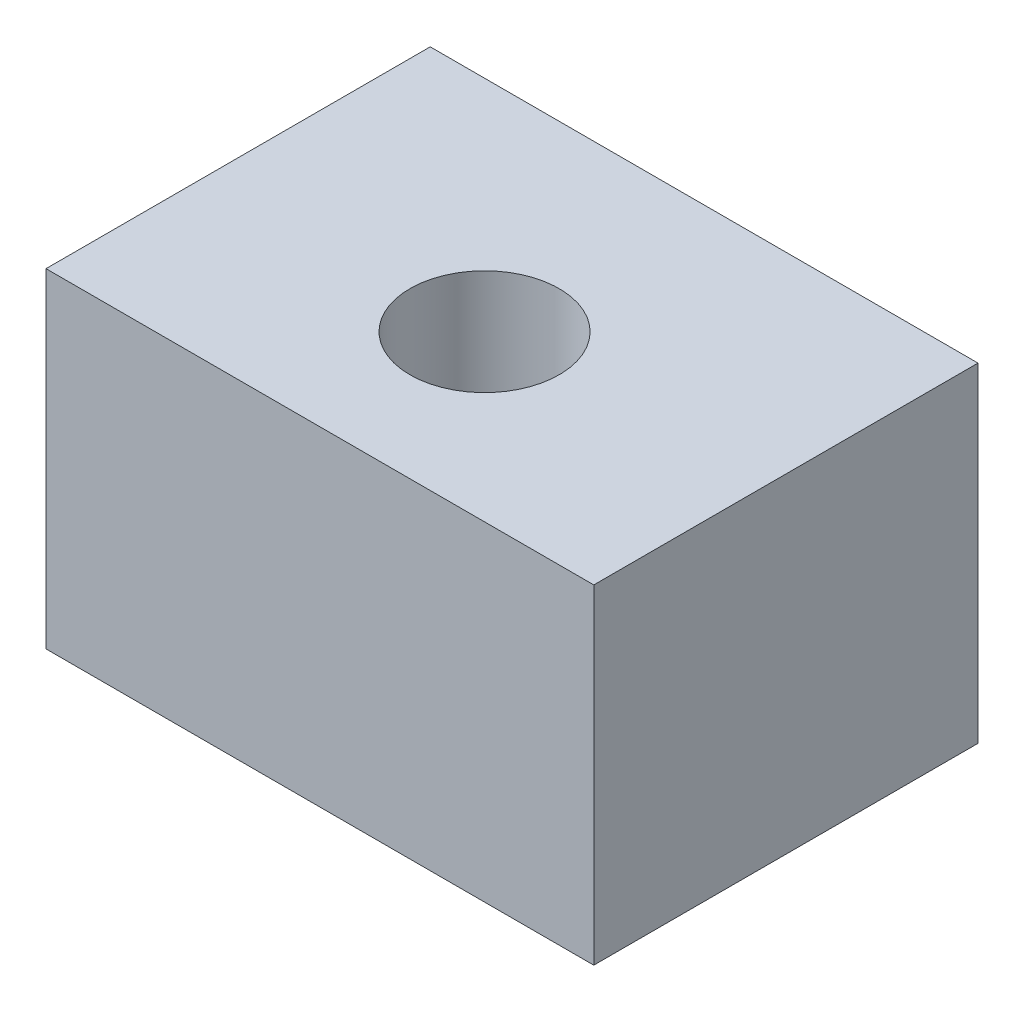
ISO-10303-21;
HEADER;
FILE_DESCRIPTION(('STEP AP214'),'2;1');
FILE_NAME('part.step','',(''),(''),'','','');
FILE_SCHEMA(('AUTOMOTIVE_DESIGN { 1 0 10303 214 1 1 1 1 }'));
ENDSEC;
DATA;
#1=APPLICATION_CONTEXT('core data for automotive mechanical design processes');
#2=APPLICATION_PROTOCOL_DEFINITION('international standard','automotive_design',2000,#1);
#3=PRODUCT_CONTEXT('',#1,'mechanical');
#4=PRODUCT('Part','Part','',(#3));
#5=PRODUCT_RELATED_PRODUCT_CATEGORY('part','',(#4));
#6=PRODUCT_DEFINITION_FORMATION('','',#4);
#7=PRODUCT_DEFINITION_CONTEXT('part definition',#1,'design');
#8=PRODUCT_DEFINITION('design','',#6,#7);
#9=PRODUCT_DEFINITION_SHAPE('','',#8);
#10=(LENGTH_UNIT() NAMED_UNIT(*) SI_UNIT(.MILLI.,.METRE.));
#11=(NAMED_UNIT(*) PLANE_ANGLE_UNIT() SI_UNIT($,.RADIAN.));
#12=(NAMED_UNIT(*) SI_UNIT($,.STERADIAN.) SOLID_ANGLE_UNIT());
#13=UNCERTAINTY_MEASURE_WITH_UNIT(LENGTH_MEASURE(1.E-05),#10,'distance_accuracy_value','');
#14=(GEOMETRIC_REPRESENTATION_CONTEXT(3) GLOBAL_UNCERTAINTY_ASSIGNED_CONTEXT((#13)) GLOBAL_UNIT_ASSIGNED_CONTEXT((#10,
#11,#12)) REPRESENTATION_CONTEXT('',''));
#15=CARTESIAN_POINT('',(0.,0.,0.));
#16=DIRECTION('',(0.,0.,1.));
#17=DIRECTION('',(1.,0.,0.));
#18=AXIS2_PLACEMENT_3D('',#15,#16,#17);
#19=CARTESIAN_POINT('',(0.,0.,8.89));
#20=DIRECTION('',(1.,0.,0.));
#21=DIRECTION('',(0.,0.,-1.));
#22=AXIS2_PLACEMENT_3D('',#19,#20,#21);
#23=PLANE('',#22);
#24=DIRECTION('',(0.,-1.,0.));
#25=VECTOR('',#24,1.);
#26=CARTESIAN_POINT('',(0.,0.,0.));
#27=LINE('',#26,#25);
#28=CARTESIAN_POINT('',(0.,7.62,0.));
#29=VERTEX_POINT('',#28);
#30=CARTESIAN_POINT('',(0.,0.,0.));
#31=VERTEX_POINT('',#30);
#32=EDGE_CURVE('E114',#29,#31,#27,.T.);
#33=ORIENTED_EDGE('',*,*,#32,.T.);
#34=DIRECTION('',(0.,0.,-1.));
#35=VECTOR('',#34,1.);
#36=CARTESIAN_POINT('',(0.,0.,8.89));
#37=LINE('',#36,#35);
#38=CARTESIAN_POINT('',(0.,0.,8.89));
#39=VERTEX_POINT('',#38);
#40=EDGE_CURVE('E11',#39,#31,#37,.T.);
#41=ORIENTED_EDGE('',*,*,#40,.F.);
#42=DIRECTION('',(0.,-1.,0.));
#43=VECTOR('',#42,1.);
#44=CARTESIAN_POINT('',(0.,0.,8.89));
#45=LINE('',#44,#43);
#46=CARTESIAN_POINT('',(0.,7.62,8.89));
#47=VERTEX_POINT('',#46);
#48=EDGE_CURVE('E97',#47,#39,#45,.T.);
#49=ORIENTED_EDGE('',*,*,#48,.F.);
#50=DIRECTION('',(0.,0.,-1.));
#51=VECTOR('',#50,1.);
#52=CARTESIAN_POINT('',(0.,7.62,8.89));
#53=LINE('',#52,#51);
#54=EDGE_CURVE('E110',#47,#29,#53,.T.);
#55=ORIENTED_EDGE('',*,*,#54,.T.);
#56=EDGE_LOOP('',(#33,#41,#49,#55));
#57=FACE_BOUND('',#56,.T.);
#58=ADVANCED_FACE('F45',(#57),#23,.F.);
#59=CARTESIAN_POINT('',(0.,0.,8.89));
#60=DIRECTION('',(0.,1.,0.));
#61=DIRECTION('',(0.,0.,1.));
#62=AXIS2_PLACEMENT_3D('',#59,#60,#61);
#63=PLANE('',#62);
#64=CARTESIAN_POINT('',(6.3373,0.,5.08));
#65=DIRECTION('',(0.,1.,0.));
#66=DIRECTION('',(0.,0.,1.));
#67=AXIS2_PLACEMENT_3D('',#64,#65,#66);
#68=CIRCLE('',#67,1.7272);
#69=CARTESIAN_POINT('',(6.3373,0.,6.8072));
#70=VERTEX_POINT('',#69);
#71=EDGE_CURVE('E118',#70,#70,#68,.T.);
#72=ORIENTED_EDGE('',*,*,#71,.T.);
#73=EDGE_LOOP('',(#72));
#74=FACE_BOUND('',#73,.T.);
#75=DIRECTION('',(1.,0.,0.));
#76=VECTOR('',#75,1.);
#77=CARTESIAN_POINT('',(0.,0.,0.));
#78=LINE('',#77,#76);
#79=CARTESIAN_POINT('',(12.6746,0.,0.));
#80=VERTEX_POINT('',#79);
#81=EDGE_CURVE('E102',#31,#80,#78,.T.);
#82=ORIENTED_EDGE('',*,*,#81,.T.);
#83=DIRECTION('',(0.,0.,-1.));
#84=VECTOR('',#83,1.);
#85=CARTESIAN_POINT('',(12.6746,0.,8.89));
#86=LINE('',#85,#84);
#87=CARTESIAN_POINT('',(12.6746,0.,8.89));
#88=VERTEX_POINT('',#87);
#89=EDGE_CURVE('E54',#88,#80,#86,.T.);
#90=ORIENTED_EDGE('',*,*,#89,.F.);
#91=DIRECTION('',(1.,0.,0.));
#92=VECTOR('',#91,1.);
#93=CARTESIAN_POINT('',(0.,0.,8.89));
#94=LINE('',#93,#92);
#95=EDGE_CURVE('E92',#39,#88,#94,.T.);
#96=ORIENTED_EDGE('',*,*,#95,.F.);
#97=ORIENTED_EDGE('',*,*,#40,.T.);
#98=EDGE_LOOP('',(#82,#90,#96,#97));
#99=FACE_BOUND('',#98,.T.);
#100=ADVANCED_FACE('F101',(#74,#99),#63,.F.);
#101=CARTESIAN_POINT('',(12.6746,0.,8.89));
#102=DIRECTION('',(-1.,0.,0.));
#103=DIRECTION('',(0.,0.,1.));
#104=AXIS2_PLACEMENT_3D('',#101,#102,#103);
#105=PLANE('',#104);
#106=DIRECTION('',(0.,1.,0.));
#107=VECTOR('',#106,1.);
#108=CARTESIAN_POINT('',(12.6746,0.,0.));
#109=LINE('',#108,#107);
#110=CARTESIAN_POINT('',(12.6746,7.62,0.));
#111=VERTEX_POINT('',#110);
#112=EDGE_CURVE('E79',#80,#111,#109,.T.);
#113=ORIENTED_EDGE('',*,*,#112,.T.);
#114=DIRECTION('',(0.,0.,-1.));
#115=VECTOR('',#114,1.);
#116=CARTESIAN_POINT('',(12.6746,7.62,8.89));
#117=LINE('',#116,#115);
#118=CARTESIAN_POINT('',(12.6746,7.62,8.89));
#119=VERTEX_POINT('',#118);
#120=EDGE_CURVE('E104',#119,#111,#117,.T.);
#121=ORIENTED_EDGE('',*,*,#120,.F.);
#122=DIRECTION('',(0.,1.,0.));
#123=VECTOR('',#122,1.);
#124=CARTESIAN_POINT('',(12.6746,0.,8.89));
#125=LINE('',#124,#123);
#126=EDGE_CURVE('E95',#88,#119,#125,.T.);
#127=ORIENTED_EDGE('',*,*,#126,.F.);
#128=ORIENTED_EDGE('',*,*,#89,.T.);
#129=EDGE_LOOP('',(#113,#121,#127,#128));
#130=FACE_BOUND('',#129,.T.);
#131=ADVANCED_FACE('F105',(#130),#105,.F.);
#132=CARTESIAN_POINT('',(0.,7.62,8.89));
#133=DIRECTION('',(0.,-1.,0.));
#134=DIRECTION('',(0.,0.,-1.));
#135=AXIS2_PLACEMENT_3D('',#132,#133,#134);
#136=PLANE('',#135);
#137=CARTESIAN_POINT('',(6.3373,7.62,5.08));
#138=DIRECTION('',(0.,1.,0.));
#139=DIRECTION('',(0.,0.,1.));
#140=AXIS2_PLACEMENT_3D('',#137,#138,#139);
#141=CIRCLE('',#140,1.7272);
#142=CARTESIAN_POINT('',(6.3373,7.62,6.8072));
#143=VERTEX_POINT('',#142);
#144=EDGE_CURVE('E138',#143,#143,#141,.T.);
#145=ORIENTED_EDGE('',*,*,#144,.F.);
#146=EDGE_LOOP('',(#145));
#147=FACE_BOUND('',#146,.T.);
#148=DIRECTION('',(-1.,0.,0.));
#149=VECTOR('',#148,1.);
#150=CARTESIAN_POINT('',(0.,7.62,0.));
#151=LINE('',#150,#149);
#152=EDGE_CURVE('E85',#111,#29,#151,.T.);
#153=ORIENTED_EDGE('',*,*,#152,.T.);
#154=ORIENTED_EDGE('',*,*,#54,.F.);
#155=DIRECTION('',(-1.,0.,0.));
#156=VECTOR('',#155,1.);
#157=CARTESIAN_POINT('',(0.,7.62,8.89));
#158=LINE('',#157,#156);
#159=EDGE_CURVE('E62',#119,#47,#158,.T.);
#160=ORIENTED_EDGE('',*,*,#159,.F.);
#161=ORIENTED_EDGE('',*,*,#120,.T.);
#162=EDGE_LOOP('',(#153,#154,#160,#161));
#163=FACE_BOUND('',#162,.T.);
#164=ADVANCED_FACE('F128',(#147,#163),#136,.F.);
#165=CARTESIAN_POINT('',(0.,0.,8.89));
#166=DIRECTION('',(0.,0.,-1.));
#167=DIRECTION('',(-1.,0.,0.));
#168=AXIS2_PLACEMENT_3D('',#165,#166,#167);
#169=PLANE('',#168);
#170=ORIENTED_EDGE('',*,*,#48,.T.);
#171=ORIENTED_EDGE('',*,*,#95,.T.);
#172=ORIENTED_EDGE('',*,*,#126,.T.);
#173=ORIENTED_EDGE('',*,*,#159,.T.);
#174=EDGE_LOOP('',(#170,#171,#172,#173));
#175=FACE_BOUND('',#174,.T.);
#176=ADVANCED_FACE('F93',(#175),#169,.F.);
#177=CARTESIAN_POINT('',(0.,0.,0.));
#178=DIRECTION('',(0.,0.,-1.));
#179=DIRECTION('',(-1.,0.,0.));
#180=AXIS2_PLACEMENT_3D('',#177,#178,#179);
#181=PLANE('',#180);
#182=ORIENTED_EDGE('',*,*,#32,.F.);
#183=ORIENTED_EDGE('',*,*,#152,.F.);
#184=ORIENTED_EDGE('',*,*,#112,.F.);
#185=ORIENTED_EDGE('',*,*,#81,.F.);
#186=EDGE_LOOP('',(#182,#183,#184,#185));
#187=FACE_BOUND('',#186,.T.);
#188=ADVANCED_FACE('F131',(#187),#181,.T.);
#189=CARTESIAN_POINT('',(6.3373,7.62,5.08));
#190=DIRECTION('',(0.,1.,0.));
#191=DIRECTION('',(0.,0.,1.));
#192=AXIS2_PLACEMENT_3D('',#189,#190,#191);
#193=CYLINDRICAL_SURFACE('',#192,1.7272);
#194=ORIENTED_EDGE('',*,*,#71,.F.);
#195=EDGE_LOOP('',(#194));
#196=FACE_BOUND('',#195,.T.);
#197=ORIENTED_EDGE('',*,*,#144,.T.);
#198=EDGE_LOOP('',(#197));
#199=FACE_BOUND('',#198,.T.);
#200=ADVANCED_FACE('F142',(#196,#199),#193,.F.);
#201=CLOSED_SHELL('',(#58,#100,#131,#164,#176,#188,#200));
#202=MANIFOLD_SOLID_BREP('B2',#201);
#203=ADVANCED_BREP_SHAPE_REPRESENTATION('',(#18,#202),#14);
#204=SHAPE_DEFINITION_REPRESENTATION(#9,#203);
ENDSEC;
END-ISO-10303-21;
